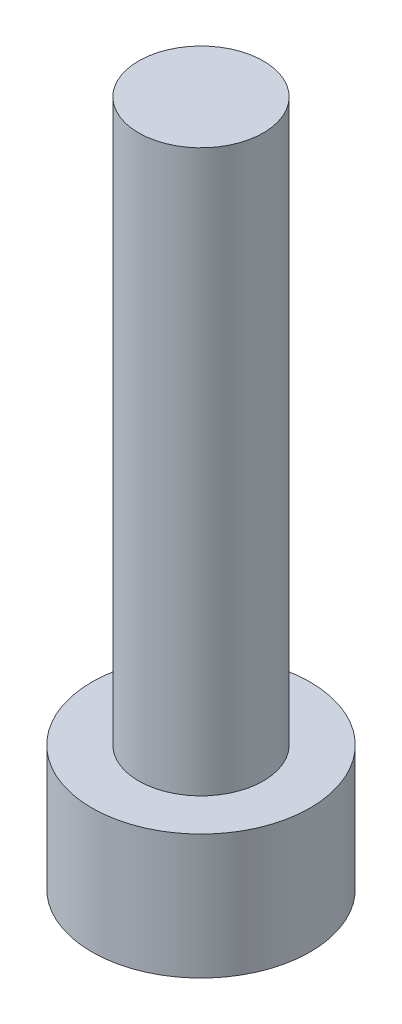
ISO-10303-21;
HEADER;
FILE_DESCRIPTION(('STEP AP214'),'2;1');
FILE_NAME('part.step','',(''),(''),'','','');
FILE_SCHEMA(('AUTOMOTIVE_DESIGN { 1 0 10303 214 1 1 1 1 }'));
ENDSEC;
DATA;
#1=APPLICATION_CONTEXT('core data for automotive mechanical design processes');
#2=APPLICATION_PROTOCOL_DEFINITION('international standard','automotive_design',2000,#1);
#3=PRODUCT_CONTEXT('',#1,'mechanical');
#4=PRODUCT('Part','Part','',(#3));
#5=PRODUCT_RELATED_PRODUCT_CATEGORY('part','',(#4));
#6=PRODUCT_DEFINITION_FORMATION('','',#4);
#7=PRODUCT_DEFINITION_CONTEXT('part definition',#1,'design');
#8=PRODUCT_DEFINITION('design','',#6,#7);
#9=PRODUCT_DEFINITION_SHAPE('','',#8);
#10=(LENGTH_UNIT() NAMED_UNIT(*) SI_UNIT(.MILLI.,.METRE.));
#11=(NAMED_UNIT(*) PLANE_ANGLE_UNIT() SI_UNIT($,.RADIAN.));
#12=(NAMED_UNIT(*) SI_UNIT($,.STERADIAN.) SOLID_ANGLE_UNIT());
#13=UNCERTAINTY_MEASURE_WITH_UNIT(LENGTH_MEASURE(1.E-05),#10,'distance_accuracy_value','');
#14=(GEOMETRIC_REPRESENTATION_CONTEXT(3) GLOBAL_UNCERTAINTY_ASSIGNED_CONTEXT((#13)) GLOBAL_UNIT_ASSIGNED_CONTEXT((#10,
#11,#12)) REPRESENTATION_CONTEXT('',''));
#15=CARTESIAN_POINT('',(0.,0.,0.));
#16=DIRECTION('',(0.,0.,1.));
#17=DIRECTION('',(1.,0.,0.));
#18=AXIS2_PLACEMENT_3D('',#15,#16,#17);
#19=CARTESIAN_POINT('',(0.,4.,0.));
#20=DIRECTION('',(0.,-1.,0.));
#21=DIRECTION('',(0.,0.,-1.));
#22=AXIS2_PLACEMENT_3D('',#19,#20,#21);
#23=CYLINDRICAL_SURFACE('',#22,3.5);
#24=CARTESIAN_POINT('',(0.,4.,0.));
#25=DIRECTION('',(0.,1.,0.));
#26=DIRECTION('',(0.,0.,1.));
#27=AXIS2_PLACEMENT_3D('',#24,#25,#26);
#28=CIRCLE('',#27,3.5);
#29=CARTESIAN_POINT('',(0.,4.,3.5));
#30=VERTEX_POINT('',#29);
#31=EDGE_CURVE('E51',#30,#30,#28,.T.);
#32=ORIENTED_EDGE('',*,*,#31,.F.);
#33=EDGE_LOOP('',(#32));
#34=FACE_BOUND('',#33,.T.);
#35=CARTESIAN_POINT('',(0.,0.,0.));
#36=DIRECTION('',(0.,1.,0.));
#37=DIRECTION('',(0.,0.,1.));
#38=AXIS2_PLACEMENT_3D('',#35,#36,#37);
#39=CIRCLE('',#38,3.5);
#40=CARTESIAN_POINT('',(0.,0.,3.5));
#41=VERTEX_POINT('',#40);
#42=EDGE_CURVE('E46',#41,#41,#39,.T.);
#43=ORIENTED_EDGE('',*,*,#42,.T.);
#44=EDGE_LOOP('',(#43));
#45=FACE_BOUND('',#44,.T.);
#46=ADVANCED_FACE('F43',(#34,#45),#23,.T.);
#47=CARTESIAN_POINT('',(0.,4.,0.));
#48=DIRECTION('',(0.,1.,0.));
#49=DIRECTION('',(0.,0.,1.));
#50=AXIS2_PLACEMENT_3D('',#47,#48,#49);
#51=PLANE('',#50);
#52=CARTESIAN_POINT('',(0.,4.,0.));
#53=DIRECTION('',(0.,1.,0.));
#54=DIRECTION('',(0.,0.,1.));
#55=AXIS2_PLACEMENT_3D('',#52,#53,#54);
#56=CIRCLE('',#55,2.);
#57=CARTESIAN_POINT('',(0.,4.,2.));
#58=VERTEX_POINT('',#57);
#59=EDGE_CURVE('E11',#58,#58,#56,.T.);
#60=ORIENTED_EDGE('',*,*,#59,.F.);
#61=EDGE_LOOP('',(#60));
#62=FACE_BOUND('',#61,.T.);
#63=ORIENTED_EDGE('',*,*,#31,.T.);
#64=EDGE_LOOP('',(#63));
#65=FACE_BOUND('',#64,.T.);
#66=ADVANCED_FACE('F161',(#62,#65),#51,.T.);
#67=CARTESIAN_POINT('',(0.,0.,0.));
#68=DIRECTION('',(0.,1.,0.));
#69=DIRECTION('',(0.,0.,1.));
#70=AXIS2_PLACEMENT_3D('',#67,#68,#69);
#71=PLANE('',#70);
#72=DIRECTION('',(0.221168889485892,0.,0.975235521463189));
#73=VECTOR('',#72,1.);
#74=CARTESIAN_POINT('',(1.27131540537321,0.,-1.17633207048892));
#75=LINE('',#74,#73);
#76=CARTESIAN_POINT('',(1.27131540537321,0.,-1.17633207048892));
#77=VERTEX_POINT('',#76);
#78=CARTESIAN_POINT('',(1.65439115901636,0.,0.512825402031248));
#79=VERTEX_POINT('',#78);
#80=EDGE_CURVE('E134',#77,#79,#75,.T.);
#81=ORIENTED_EDGE('',*,*,#80,.F.);
#82=DIRECTION('',(0.955163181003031,0.,0.296079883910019));
#83=VECTOR('',#82,1.);
#84=CARTESIAN_POINT('',(-0.38307575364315,0.,-1.68915747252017));
#85=LINE('',#84,#83);
#86=CARTESIAN_POINT('',(-0.38307575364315,0.,-1.68915747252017));
#87=VERTEX_POINT('',#86);
#88=EDGE_CURVE('E56',#87,#77,#85,.T.);
#89=ORIENTED_EDGE('',*,*,#88,.F.);
#90=DIRECTION('',(0.733994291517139,0.,-0.67915563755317));
#91=VECTOR('',#90,1.);
#92=CARTESIAN_POINT('',(-1.65439115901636,0.,-0.512825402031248));
#93=LINE('',#92,#91);
#94=CARTESIAN_POINT('',(-1.65439115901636,0.,-0.512825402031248));
#95=VERTEX_POINT('',#94);
#96=EDGE_CURVE('E145',#95,#87,#93,.T.);
#97=ORIENTED_EDGE('',*,*,#96,.F.);
#98=DIRECTION('',(-0.221168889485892,0.,-0.975235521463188));
#99=VECTOR('',#98,1.);
#100=CARTESIAN_POINT('',(-1.27131540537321,0.,1.17633207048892));
#101=LINE('',#100,#99);
#102=CARTESIAN_POINT('',(-1.27131540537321,0.,1.17633207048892));
#103=VERTEX_POINT('',#102);
#104=EDGE_CURVE('E140',#103,#95,#101,.T.);
#105=ORIENTED_EDGE('',*,*,#104,.F.);
#106=DIRECTION('',(-0.955163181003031,0.,-0.296079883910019));
#107=VECTOR('',#106,1.);
#108=CARTESIAN_POINT('',(0.383075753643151,0.,1.68915747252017));
#109=LINE('',#108,#107);
#110=CARTESIAN_POINT('',(0.383075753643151,0.,1.68915747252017));
#111=VERTEX_POINT('',#110);
#112=EDGE_CURVE('E110',#111,#103,#109,.T.);
#113=ORIENTED_EDGE('',*,*,#112,.F.);
#114=DIRECTION('',(-0.733994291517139,0.,0.67915563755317));
#115=VECTOR('',#114,1.);
#116=CARTESIAN_POINT('',(1.65439115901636,0.,0.512825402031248));
#117=LINE('',#116,#115);
#118=EDGE_CURVE('E136',#79,#111,#117,.T.);
#119=ORIENTED_EDGE('',*,*,#118,.F.);
#120=EDGE_LOOP('',(#81,#89,#97,#105,#113,#119));
#121=FACE_BOUND('',#120,.T.);
#122=ORIENTED_EDGE('',*,*,#42,.F.);
#123=EDGE_LOOP('',(#122));
#124=FACE_BOUND('',#123,.T.);
#125=ADVANCED_FACE('F160',(#121,#124),#71,.F.);
#126=CARTESIAN_POINT('',(0.,22.,0.));
#127=DIRECTION('',(0.,-1.,0.));
#128=DIRECTION('',(0.,0.,-1.));
#129=AXIS2_PLACEMENT_3D('',#126,#127,#128);
#130=CYLINDRICAL_SURFACE('',#129,2.);
#131=CARTESIAN_POINT('',(0.,22.,0.));
#132=DIRECTION('',(0.,1.,0.));
#133=DIRECTION('',(0.,0.,1.));
#134=AXIS2_PLACEMENT_3D('',#131,#132,#133);
#135=CIRCLE('',#134,2.);
#136=CARTESIAN_POINT('',(0.,22.,2.));
#137=VERTEX_POINT('',#136);
#138=EDGE_CURVE('E147',#137,#137,#135,.T.);
#139=ORIENTED_EDGE('',*,*,#138,.F.);
#140=EDGE_LOOP('',(#139));
#141=FACE_BOUND('',#140,.T.);
#142=ORIENTED_EDGE('',*,*,#59,.T.);
#143=EDGE_LOOP('',(#142));
#144=FACE_BOUND('',#143,.T.);
#145=ADVANCED_FACE('F162',(#141,#144),#130,.T.);
#146=CARTESIAN_POINT('',(0.,22.,0.));
#147=DIRECTION('',(0.,1.,0.));
#148=DIRECTION('',(0.,0.,1.));
#149=AXIS2_PLACEMENT_3D('',#146,#147,#148);
#150=PLANE('',#149);
#151=ORIENTED_EDGE('',*,*,#138,.T.);
#152=EDGE_LOOP('',(#151));
#153=FACE_BOUND('',#152,.T.);
#154=ADVANCED_FACE('F167',(#153),#150,.T.);
#155=CARTESIAN_POINT('',(-0.38307575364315,1.5,-1.68915747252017));
#156=DIRECTION('',(0.296079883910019,0.,-0.955163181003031));
#157=DIRECTION('',(-0.955163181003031,0.,-0.296079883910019));
#158=AXIS2_PLACEMENT_3D('',#155,#156,#157);
#159=PLANE('',#158);
#160=ORIENTED_EDGE('',*,*,#88,.T.);
#161=DIRECTION('',(0.,-1.,0.));
#162=VECTOR('',#161,1.);
#163=CARTESIAN_POINT('',(1.27131540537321,1.5,-1.17633207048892));
#164=LINE('',#163,#162);
#165=CARTESIAN_POINT('',(1.27131540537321,1.5,-1.17633207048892));
#166=VERTEX_POINT('',#165);
#167=EDGE_CURVE('E86',#166,#77,#164,.T.);
#168=ORIENTED_EDGE('',*,*,#167,.F.);
#169=DIRECTION('',(0.955163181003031,0.,0.296079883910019));
#170=VECTOR('',#169,1.);
#171=CARTESIAN_POINT('',(-0.38307575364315,1.5,-1.68915747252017));
#172=LINE('',#171,#170);
#173=CARTESIAN_POINT('',(-0.38307575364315,1.5,-1.68915747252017));
#174=VERTEX_POINT('',#173);
#175=EDGE_CURVE('E144',#174,#166,#172,.T.);
#176=ORIENTED_EDGE('',*,*,#175,.F.);
#177=DIRECTION('',(0.,-1.,0.));
#178=VECTOR('',#177,1.);
#179=CARTESIAN_POINT('',(-0.38307575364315,1.5,-1.68915747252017));
#180=LINE('',#179,#178);
#181=EDGE_CURVE('E70',#174,#87,#180,.T.);
#182=ORIENTED_EDGE('',*,*,#181,.T.);
#183=EDGE_LOOP('',(#160,#168,#176,#182));
#184=FACE_BOUND('',#183,.T.);
#185=ADVANCED_FACE('F199',(#184),#159,.F.);
#186=CARTESIAN_POINT('',(-1.65439115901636,1.5,-0.512825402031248));
#187=DIRECTION('',(-0.67915563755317,0.,-0.733994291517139));
#188=DIRECTION('',(-0.733994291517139,0.,0.67915563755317));
#189=AXIS2_PLACEMENT_3D('',#186,#187,#188);
#190=PLANE('',#189);
#191=ORIENTED_EDGE('',*,*,#96,.T.);
#192=ORIENTED_EDGE('',*,*,#181,.F.);
#193=DIRECTION('',(0.733994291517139,0.,-0.67915563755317));
#194=VECTOR('',#193,1.);
#195=CARTESIAN_POINT('',(-1.65439115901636,1.5,-0.512825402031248));
#196=LINE('',#195,#194);
#197=CARTESIAN_POINT('',(-1.65439115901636,1.5,-0.512825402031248));
#198=VERTEX_POINT('',#197);
#199=EDGE_CURVE('E118',#198,#174,#196,.T.);
#200=ORIENTED_EDGE('',*,*,#199,.F.);
#201=DIRECTION('',(0.,-1.,0.));
#202=VECTOR('',#201,1.);
#203=CARTESIAN_POINT('',(-1.65439115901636,1.5,-0.512825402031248));
#204=LINE('',#203,#202);
#205=EDGE_CURVE('E111',#198,#95,#204,.T.);
#206=ORIENTED_EDGE('',*,*,#205,.T.);
#207=EDGE_LOOP('',(#191,#192,#200,#206));
#208=FACE_BOUND('',#207,.T.);
#209=ADVANCED_FACE('F208',(#208),#190,.F.);
#210=CARTESIAN_POINT('',(-1.27131540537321,1.5,1.17633207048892));
#211=DIRECTION('',(-0.975235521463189,0.,0.221168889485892));
#212=DIRECTION('',(0.221168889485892,0.,0.975235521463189));
#213=AXIS2_PLACEMENT_3D('',#210,#211,#212);
#214=PLANE('',#213);
#215=ORIENTED_EDGE('',*,*,#104,.T.);
#216=ORIENTED_EDGE('',*,*,#205,.F.);
#217=DIRECTION('',(-0.221168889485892,0.,-0.975235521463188));
#218=VECTOR('',#217,1.);
#219=CARTESIAN_POINT('',(-1.27131540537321,1.5,1.17633207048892));
#220=LINE('',#219,#218);
#221=CARTESIAN_POINT('',(-1.27131540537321,1.5,1.17633207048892));
#222=VERTEX_POINT('',#221);
#223=EDGE_CURVE('E114',#222,#198,#220,.T.);
#224=ORIENTED_EDGE('',*,*,#223,.F.);
#225=DIRECTION('',(0.,-1.,0.));
#226=VECTOR('',#225,1.);
#227=CARTESIAN_POINT('',(-1.27131540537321,1.5,1.17633207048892));
#228=LINE('',#227,#226);
#229=EDGE_CURVE('E99',#222,#103,#228,.T.);
#230=ORIENTED_EDGE('',*,*,#229,.T.);
#231=EDGE_LOOP('',(#215,#216,#224,#230));
#232=FACE_BOUND('',#231,.T.);
#233=ADVANCED_FACE('F116',(#232),#214,.F.);
#234=CARTESIAN_POINT('',(0.383075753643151,1.5,1.68915747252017));
#235=DIRECTION('',(-0.296079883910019,0.,0.955163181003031));
#236=DIRECTION('',(0.955163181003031,0.,0.296079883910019));
#237=AXIS2_PLACEMENT_3D('',#234,#235,#236);
#238=PLANE('',#237);
#239=ORIENTED_EDGE('',*,*,#112,.T.);
#240=ORIENTED_EDGE('',*,*,#229,.F.);
#241=DIRECTION('',(-0.955163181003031,0.,-0.296079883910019));
#242=VECTOR('',#241,1.);
#243=CARTESIAN_POINT('',(0.383075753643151,1.5,1.68915747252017));
#244=LINE('',#243,#242);
#245=CARTESIAN_POINT('',(0.383075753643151,1.5,1.68915747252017));
#246=VERTEX_POINT('',#245);
#247=EDGE_CURVE('E104',#246,#222,#244,.T.);
#248=ORIENTED_EDGE('',*,*,#247,.F.);
#249=DIRECTION('',(0.,-1.,0.));
#250=VECTOR('',#249,1.);
#251=CARTESIAN_POINT('',(0.383075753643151,1.5,1.68915747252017));
#252=LINE('',#251,#250);
#253=EDGE_CURVE('E115',#246,#111,#252,.T.);
#254=ORIENTED_EDGE('',*,*,#253,.T.);
#255=EDGE_LOOP('',(#239,#240,#248,#254));
#256=FACE_BOUND('',#255,.T.);
#257=ADVANCED_FACE('F105',(#256),#238,.F.);
#258=CARTESIAN_POINT('',(1.65439115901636,1.5,0.512825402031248));
#259=DIRECTION('',(0.67915563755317,0.,0.733994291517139));
#260=DIRECTION('',(0.733994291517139,0.,-0.67915563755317));
#261=AXIS2_PLACEMENT_3D('',#258,#259,#260);
#262=PLANE('',#261);
#263=ORIENTED_EDGE('',*,*,#118,.T.);
#264=ORIENTED_EDGE('',*,*,#253,.F.);
#265=DIRECTION('',(-0.733994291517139,0.,0.67915563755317));
#266=VECTOR('',#265,1.);
#267=CARTESIAN_POINT('',(1.65439115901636,1.5,0.512825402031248));
#268=LINE('',#267,#266);
#269=CARTESIAN_POINT('',(1.65439115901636,1.5,0.512825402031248));
#270=VERTEX_POINT('',#269);
#271=EDGE_CURVE('E123',#270,#246,#268,.T.);
#272=ORIENTED_EDGE('',*,*,#271,.F.);
#273=DIRECTION('',(0.,-1.,0.));
#274=VECTOR('',#273,1.);
#275=CARTESIAN_POINT('',(1.65439115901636,1.5,0.512825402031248));
#276=LINE('',#275,#274);
#277=EDGE_CURVE('E146',#270,#79,#276,.T.);
#278=ORIENTED_EDGE('',*,*,#277,.T.);
#279=EDGE_LOOP('',(#263,#264,#272,#278));
#280=FACE_BOUND('',#279,.T.);
#281=ADVANCED_FACE('F232',(#280),#262,.F.);
#282=CARTESIAN_POINT('',(1.27131540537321,1.5,-1.17633207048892));
#283=DIRECTION('',(0.975235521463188,0.,-0.221168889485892));
#284=DIRECTION('',(-0.221168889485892,0.,-0.975235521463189));
#285=AXIS2_PLACEMENT_3D('',#282,#283,#284);
#286=PLANE('',#285);
#287=ORIENTED_EDGE('',*,*,#80,.T.);
#288=ORIENTED_EDGE('',*,*,#277,.F.);
#289=DIRECTION('',(0.221168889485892,0.,0.975235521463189));
#290=VECTOR('',#289,1.);
#291=CARTESIAN_POINT('',(1.27131540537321,1.5,-1.17633207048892));
#292=LINE('',#291,#290);
#293=EDGE_CURVE('E130',#166,#270,#292,.T.);
#294=ORIENTED_EDGE('',*,*,#293,.F.);
#295=ORIENTED_EDGE('',*,*,#167,.T.);
#296=EDGE_LOOP('',(#287,#288,#294,#295));
#297=FACE_BOUND('',#296,.T.);
#298=ADVANCED_FACE('F242',(#297),#286,.F.);
#299=CARTESIAN_POINT('',(0.,1.5,0.));
#300=DIRECTION('',(0.,-1.,0.));
#301=DIRECTION('',(0.,0.,-1.));
#302=AXIS2_PLACEMENT_3D('',#299,#300,#301);
#303=PLANE('',#302);
#304=ORIENTED_EDGE('',*,*,#175,.T.);
#305=ORIENTED_EDGE('',*,*,#293,.T.);
#306=ORIENTED_EDGE('',*,*,#271,.T.);
#307=ORIENTED_EDGE('',*,*,#247,.T.);
#308=ORIENTED_EDGE('',*,*,#223,.T.);
#309=ORIENTED_EDGE('',*,*,#199,.T.);
#310=EDGE_LOOP('',(#304,#305,#306,#307,#308,#309));
#311=FACE_BOUND('',#310,.T.);
#312=ADVANCED_FACE('F125',(#311),#303,.T.);
#313=CLOSED_SHELL('',(#46,#66,#125,#145,#154,#185,#209,#233,#257,#281,#298,#312));
#314=MANIFOLD_SOLID_BREP('B2',#313);
#315=ADVANCED_BREP_SHAPE_REPRESENTATION('',(#18,#314),#14);
#316=SHAPE_DEFINITION_REPRESENTATION(#9,#315);
ENDSEC;
END-ISO-10303-21;
